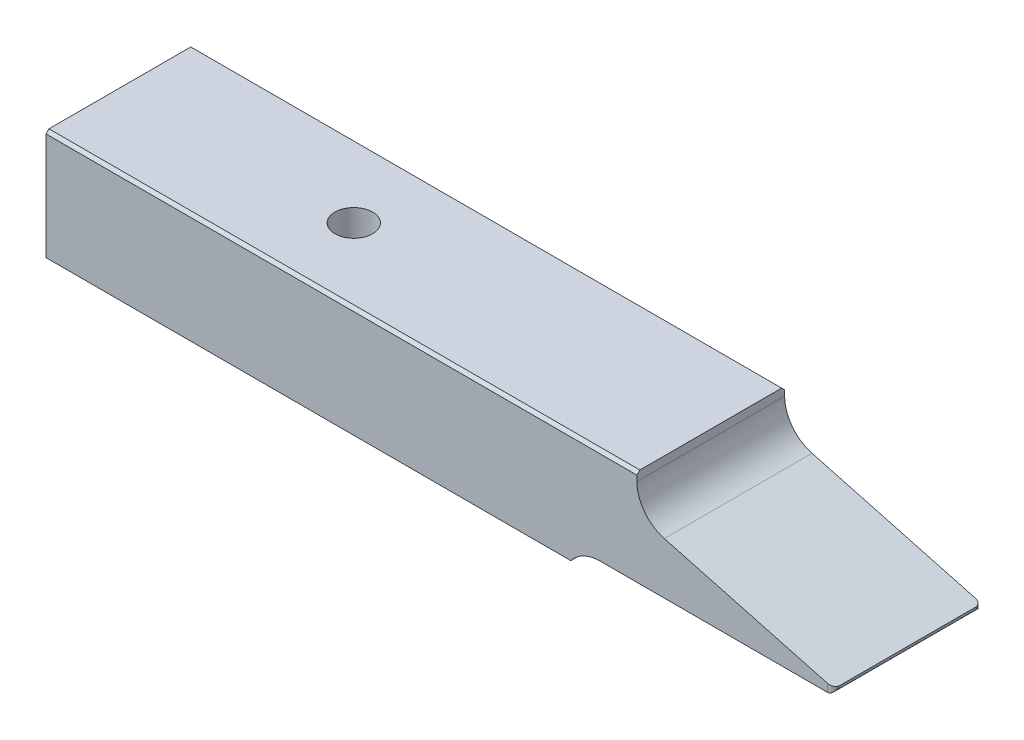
from build123d import *

# Parameters (mm, degrees)
BASE_EXTRUDE_DEPTH = 9.525
CHAMFER1_SIZE      = 0.381
SKETCH3_R          = 2.43205
CUT_EXTRUDE1_DEPTH = 6.35
TAP10_321_D        = 4.0386
TAP10_321_DEPTH    = 24.13
TAP10_321_TIP      = 1.213317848
CUT_EXTRUDE2_DEPTH = 104.028568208


with BuildPart() as part:
    # Sketch1 → Base-Extrude (new, symmetric)
    with BuildSketch(Plane.XY):
        with BuildLine():
            Line((71.4375, 1.8415), (100.80625, 1.8415))
            ThreePointArc((100.80625, 1.8415), (101.367516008, 2.073983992), (101.6, 2.63525))
            Line((101.6, 2.63525), (79.729874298, 8.49533252))
            ThreePointArc((79.729874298, 8.49533252), (77.184154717, 10.196327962), (76.2, 13.095554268))
            Line((76.2, 13.095554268), (76.2, 14.1986))
            Line((76.2, 14.1986), (0, 14.1986))
            Line((0, 14.1986), (0, 0))
            Line((0, 0), (67.675962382, 0))
            ThreePointArc((67.675962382, 0), (69.343443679, 1.356421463), (71.4375, 1.8415))
        make_face()
    extrude(amount=BASE_EXTRUDE_DEPTH, both=True)

    # Chamfer1
    chamfer1_edges = [part.edges().sort_by_distance(p)[0] for p in [
        (38.1, 14.1986, -9.525),
        (38.1, 14.1986, 9.525),
    ]]
    chamfer(chamfer1_edges, length=CHAMFER1_SIZE)

    # Sketch3 → Cut-Extrude1 (cut)
    with BuildSketch(Plane(origin=(0, 14.1986, 0), x_dir=(-1, 0, 0), z_dir=(0, 1, 0))):
        with Locations(Location((-30.1625, 0, 0), (0, 0, 90))):
            Circle(SKETCH3_R)
    extrude(amount=-CUT_EXTRUDE1_DEPTH, mode=Mode.SUBTRACT)

    # TAP10-321
    with Locations(Plane(origin=(30.418032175, 7.8486, 19.148740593), x_dir=(-1, 0, 0), z_dir=(0, 1, 0))):
        with Locations((0.255532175, -19.148740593)):
            Hole(TAP10_321_D / 2, depth=TAP10_321_DEPTH)
            with Locations((0, 0, -(TAP10_321_DEPTH + TAP10_321_TIP / 2))):  # 118° drill point
                Cone(0, TAP10_321_D / 2, TAP10_321_TIP, mode=Mode.SUBTRACT)

    # Sketch6 → Cut-Extrude2 (cut, through all)
    with BuildSketch(Plane(origin=(0, 0, 0), x_dir=(1, 0, 0), z_dir=(0, 1, 0))):
        with BuildLine():
            Line((100.80625, -9.525), (79.729874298, -9.525))
            Line((79.729874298, -9.525), (79.729874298, -15.875))
            Line((79.729874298, -15.875), (105.129874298, -15.875))
            Line((105.129874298, -15.875), (105.129874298, 15.875))
            Line((105.129874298, 15.875), (79.729874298, 15.875))
            Line((79.729874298, 15.875), (79.729874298, 9.525))
            Line((79.729874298, 9.525), (100.80625, 9.525))
            ThreePointArc((100.80625, 9.525), (101.367516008, 9.292516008), (101.6, 8.73125))
            Line((101.6, 8.73125), (101.6, -8.73125))
            ThreePointArc((101.6, -8.73125), (101.367516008, -9.292516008), (100.80625, -9.525))
        make_face()
    extrude(amount=CUT_EXTRUDE2_DEPTH, mode=Mode.SUBTRACT)


solid = part.part
